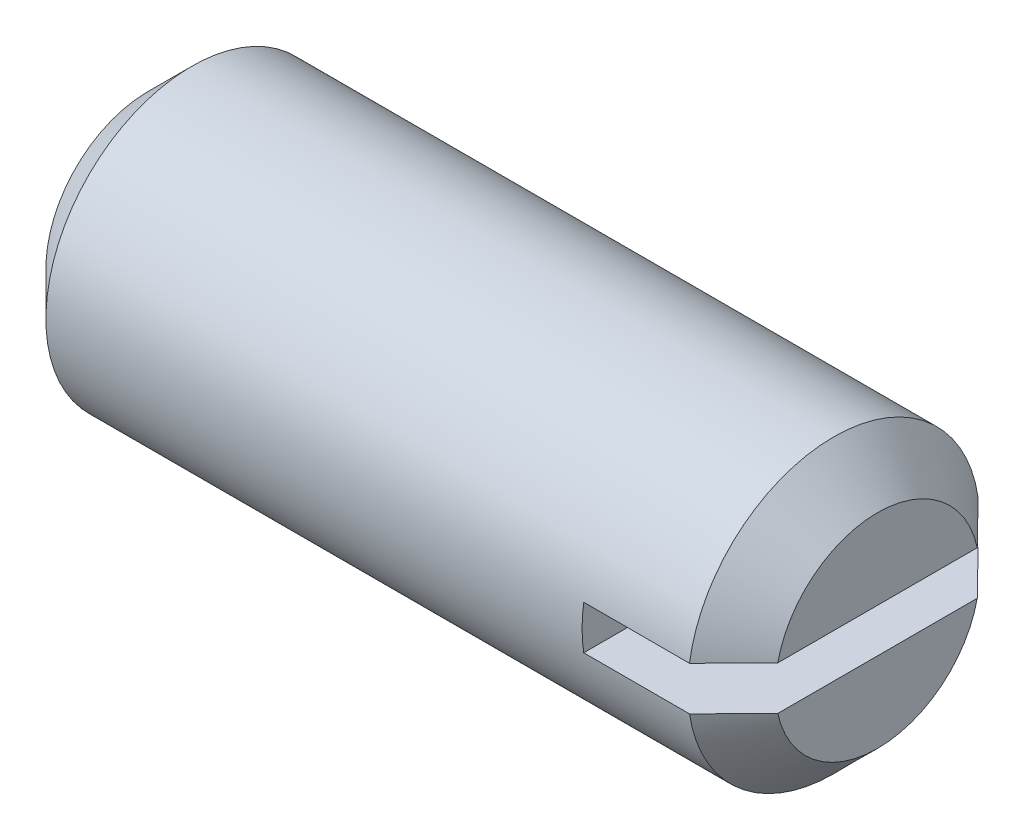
ISO-10303-21;
HEADER;
FILE_DESCRIPTION(('STEP AP214'),'2;1');
FILE_NAME('part.step','',(''),(''),'','','');
FILE_SCHEMA(('AUTOMOTIVE_DESIGN { 1 0 10303 214 1 1 1 1 }'));
ENDSEC;
DATA;
#1=APPLICATION_CONTEXT('core data for automotive mechanical design processes');
#2=APPLICATION_PROTOCOL_DEFINITION('international standard','automotive_design',2000,#1);
#3=PRODUCT_CONTEXT('',#1,'mechanical');
#4=PRODUCT('Part','Part','',(#3));
#5=PRODUCT_RELATED_PRODUCT_CATEGORY('part','',(#4));
#6=PRODUCT_DEFINITION_FORMATION('','',#4);
#7=PRODUCT_DEFINITION_CONTEXT('part definition',#1,'design');
#8=PRODUCT_DEFINITION('design','',#6,#7);
#9=PRODUCT_DEFINITION_SHAPE('','',#8);
#10=(LENGTH_UNIT() NAMED_UNIT(*) SI_UNIT(.MILLI.,.METRE.));
#11=(NAMED_UNIT(*) PLANE_ANGLE_UNIT() SI_UNIT($,.RADIAN.));
#12=(NAMED_UNIT(*) SI_UNIT($,.STERADIAN.) SOLID_ANGLE_UNIT());
#13=UNCERTAINTY_MEASURE_WITH_UNIT(LENGTH_MEASURE(1.E-05),#10,'distance_accuracy_value','');
#14=(GEOMETRIC_REPRESENTATION_CONTEXT(3) GLOBAL_UNCERTAINTY_ASSIGNED_CONTEXT((#13)) GLOBAL_UNIT_ASSIGNED_CONTEXT((#10,
#11,#12)) REPRESENTATION_CONTEXT('',''));
#15=CARTESIAN_POINT('',(0.,0.,0.));
#16=DIRECTION('',(0.,0.,1.));
#17=DIRECTION('',(1.,0.,0.));
#18=AXIS2_PLACEMENT_3D('',#15,#16,#17);
#19=CARTESIAN_POINT('',(10.,0.,0.));
#20=DIRECTION('',(1.,0.,0.));
#21=DIRECTION('',(0.,0.,-1.));
#22=AXIS2_PLACEMENT_3D('',#19,#20,#21);
#23=PLANE('',#22);
#24=DIRECTION('',(0.,0.,1.));
#25=VECTOR('',#24,1.);
#26=CARTESIAN_POINT('',(10.,-0.299999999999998,-2.));
#27=LINE('',#26,#25);
#28=CARTESIAN_POINT('',(10.,-0.299999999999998,-1.36747943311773));
#29=VERTEX_POINT('',#28);
#30=CARTESIAN_POINT('',(10.,-0.299999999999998,1.36747943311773));
#31=VERTEX_POINT('',#30);
#32=EDGE_CURVE('E106',#29,#31,#27,.T.);
#33=ORIENTED_EDGE('',*,*,#32,.T.);
#34=CARTESIAN_POINT('',(10.,0.,0.));
#35=DIRECTION('',(1.,0.,0.));
#36=DIRECTION('',(0.,0.,-1.));
#37=AXIS2_PLACEMENT_3D('',#34,#35,#36);
#38=CIRCLE('',#37,1.4);
#39=EDGE_CURVE('E110',#31,#29,#38,.T.);
#40=ORIENTED_EDGE('',*,*,#39,.T.);
#41=EDGE_LOOP('',(#33,#40));
#42=FACE_BOUND('',#41,.T.);
#43=ADVANCED_FACE('F37',(#42),#23,.T.);
#44=CARTESIAN_POINT('',(10.,0.,0.));
#45=DIRECTION('',(-1.,0.,0.));
#46=DIRECTION('',(0.,0.,1.));
#47=AXIS2_PLACEMENT_3D('',#44,#45,#46);
#48=CONICAL_SURFACE('',#47,1.4,0.785398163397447);
#49=CARTESIAN_POINT('',(6.9729501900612,-0.299999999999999,4.41687333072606));
#50=CARTESIAN_POINT('',(7.12518056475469,-0.299999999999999,4.26428929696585));
#51=CARTESIAN_POINT('',(7.2773955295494,-0.299999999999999,4.11168987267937));
#52=CARTESIAN_POINT('',(7.5817779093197,-0.299999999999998,3.80643657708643));
#53=CARTESIAN_POINT('',(7.73394532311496,-0.299999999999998,3.65378270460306));
#54=CARTESIAN_POINT('',(8.03828902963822,-0.299999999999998,3.34832340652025));
#55=CARTESIAN_POINT('',(8.19046528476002,-0.299999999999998,3.19551794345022));
#56=CARTESIAN_POINT('',(8.49470618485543,-0.299999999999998,2.88980275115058));
#57=CARTESIAN_POINT('',(8.64677083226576,-0.299999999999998,2.73689302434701));
#58=CARTESIAN_POINT('',(8.95144396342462,-0.299999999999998,2.4301728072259));
#59=CARTESIAN_POINT('',(9.10405160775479,-0.299999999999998,2.27636148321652));
#60=CARTESIAN_POINT('',(9.40896874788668,-0.299999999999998,1.96842290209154));
#61=CARTESIAN_POINT('',(9.56127822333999,-0.299999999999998,1.81429562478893));
#62=CARTESIAN_POINT('',(9.78922653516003,-0.299999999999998,1.58264732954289));
#63=CARTESIAN_POINT('',(9.86511078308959,-0.299999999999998,1.50536785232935));
#64=CARTESIAN_POINT('',(10.0166222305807,-0.299999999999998,1.35055270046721));
#65=CARTESIAN_POINT('',(10.0922494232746,-0.299999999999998,1.27301701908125));
#66=CARTESIAN_POINT('',(10.243056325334,-0.299999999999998,1.11753056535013));
#67=CARTESIAN_POINT('',(10.3182360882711,-0.299999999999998,1.0395798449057));
#68=CARTESIAN_POINT('',(10.4678059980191,-0.299999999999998,0.882925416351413));
#69=CARTESIAN_POINT('',(10.5421961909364,-0.299999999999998,0.804221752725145));
#70=CARTESIAN_POINT('',(10.6356658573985,-0.299999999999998,0.703043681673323));
#71=CARTESIAN_POINT('',(10.6555851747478,-0.299999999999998,0.681346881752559));
#72=CARTESIAN_POINT('',(10.6952398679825,-0.299999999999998,0.637784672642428));
#73=CARTESIAN_POINT('',(10.7149752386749,-0.299999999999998,0.615919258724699));
#74=CARTESIAN_POINT('',(10.7542172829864,-0.299999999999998,0.571956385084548));
#75=CARTESIAN_POINT('',(10.7737237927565,-0.299999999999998,0.549858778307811));
#76=CARTESIAN_POINT('',(10.8123947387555,-0.299999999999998,0.505370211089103));
#77=CARTESIAN_POINT('',(10.831559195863,-0.299999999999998,0.482979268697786));
#78=CARTESIAN_POINT('',(10.8806527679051,-0.299999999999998,0.424404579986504));
#79=CARTESIAN_POINT('',(10.9102267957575,-0.299999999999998,0.387914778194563));
#80=CARTESIAN_POINT('',(10.9528223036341,-0.299999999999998,0.331830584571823));
#81=CARTESIAN_POINT('',(10.9667265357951,-0.299999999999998,0.312910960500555));
#82=CARTESIAN_POINT('',(10.993636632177,-0.299999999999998,0.274447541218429));
#83=CARTESIAN_POINT('',(11.006642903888,-0.299999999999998,0.254904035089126));
#84=CARTESIAN_POINT('',(11.0315694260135,-0.299999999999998,0.214479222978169));
#85=CARTESIAN_POINT('',(11.0434566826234,-0.299999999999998,0.193577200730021));
#86=CARTESIAN_POINT('',(11.0648541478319,-0.299999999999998,0.150565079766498));
#87=CARTESIAN_POINT('',(11.0743676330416,-0.299999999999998,0.128456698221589));
#88=CARTESIAN_POINT('',(11.0877294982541,-0.299999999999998,0.0882149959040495));
#89=CARTESIAN_POINT('',(11.0923821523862,-0.299999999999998,0.0703597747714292));
#90=CARTESIAN_POINT('',(11.098585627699,-0.299999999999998,0.0341402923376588));
#91=CARTESIAN_POINT('',(11.1001458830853,-0.299999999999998,0.0157777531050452));
#92=CARTESIAN_POINT('',(11.0998316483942,-0.299999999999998,-0.020970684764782));
#93=CARTESIAN_POINT('',(11.0979468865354,-0.299999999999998,-0.0393564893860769));
#94=CARTESIAN_POINT('',(11.0911456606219,-0.299999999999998,-0.0755692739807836));
#95=CARTESIAN_POINT('',(11.0862216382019,-0.299999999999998,-0.0933947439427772));
#96=CARTESIAN_POINT('',(11.0734532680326,-0.299999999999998,-0.130257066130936));
#97=CARTESIAN_POINT('',(11.0653372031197,-0.299999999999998,-0.149195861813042));
#98=CARTESIAN_POINT('',(11.0472837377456,-0.299999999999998,-0.186199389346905));
#99=CARTESIAN_POINT('',(11.0373426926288,-0.299999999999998,-0.204262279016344));
#100=CARTESIAN_POINT('',(11.0161868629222,-0.299999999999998,-0.23983020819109));
#101=CARTESIAN_POINT('',(11.0049615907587,-0.299999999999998,-0.2573289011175));
#102=CARTESIAN_POINT('',(10.9817143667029,-0.299999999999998,-0.29175761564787));
#103=CARTESIAN_POINT('',(10.969693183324,-0.299999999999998,-0.308688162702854));
#104=CARTESIAN_POINT('',(10.9303995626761,-0.299999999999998,-0.362152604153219));
#105=CARTESIAN_POINT('',(10.9020827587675,-0.299999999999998,-0.397913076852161));
#106=CARTESIAN_POINT('',(10.8441431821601,-0.299999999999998,-0.468366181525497));
#107=CARTESIAN_POINT('',(10.8145196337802,-0.299999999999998,-0.503058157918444));
#108=CARTESIAN_POINT('',(10.7544631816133,-0.299999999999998,-0.571838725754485));
#109=CARTESIAN_POINT('',(10.724028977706,-0.299999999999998,-0.605926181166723));
#110=CARTESIAN_POINT('',(10.6626965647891,-0.299999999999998,-0.673661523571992));
#111=CARTESIAN_POINT('',(10.6317984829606,-0.299999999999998,-0.707309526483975));
#112=CARTESIAN_POINT('',(10.5389147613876,-0.299999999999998,-0.807530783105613));
#113=CARTESIAN_POINT('',(10.4764725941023,-0.299999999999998,-0.87368025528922));
#114=CARTESIAN_POINT('',(10.3510446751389,-0.299999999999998,-1.00533229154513));
#115=CARTESIAN_POINT('',(10.2880595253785,-0.299999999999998,-1.07083543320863));
#116=CARTESIAN_POINT('',(10.1580399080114,-0.299999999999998,-1.20531240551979));
#117=CARTESIAN_POINT('',(10.0909838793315,-0.299999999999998,-1.274265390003));
#118=CARTESIAN_POINT('',(9.95662574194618,-0.299999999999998,-1.41193132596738));
#119=CARTESIAN_POINT('',(9.8893236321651,-0.299999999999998,-1.48064427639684));
#120=CARTESIAN_POINT('',(9.68717692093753,-0.299999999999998,-1.68655187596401));
#121=CARTESIAN_POINT('',(9.55209434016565,-0.299999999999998,-1.82351280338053));
#122=CARTESIAN_POINT('',(9.28155242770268,-0.299999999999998,-2.0971960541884));
#123=CARTESIAN_POINT('',(9.14609294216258,-0.299999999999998,-2.23391822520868));
#124=CARTESIAN_POINT('',(8.87499302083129,-0.299999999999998,-2.50718073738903));
#125=CARTESIAN_POINT('',(8.73935258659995,-0.299999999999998,-2.64372108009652));
#126=CARTESIAN_POINT('',(8.46787274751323,-0.299999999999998,-2.91677606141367));
#127=CARTESIAN_POINT('',(8.33203327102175,-0.299999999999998,-3.0532906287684));
#128=CARTESIAN_POINT('',(8.0602782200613,-0.299999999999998,-3.32624477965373));
#129=CARTESIAN_POINT('',(7.92436264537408,-0.299999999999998,-3.46268436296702));
#130=CARTESIAN_POINT('',(7.65255240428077,-0.299999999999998,-3.73543735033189));
#131=CARTESIAN_POINT('',(7.51665776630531,-0.299999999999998,-3.87175078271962));
#132=CARTESIAN_POINT('',(7.24482977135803,-0.299999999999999,-4.14433820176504));
#133=CARTESIAN_POINT('',(7.10889641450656,-0.299999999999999,-4.28061218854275));
#134=CARTESIAN_POINT('',(6.9729501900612,-0.299999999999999,-4.41687333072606));
#135=B_SPLINE_CURVE_WITH_KNOTS('',3,(#49,#50,#51,#52,#53,#54,#55,#56,#57,#58,#59,#60,#61,#62,
#63,#64,#65,#66,#67,#68,#69,#70,#71,#72,#73,#74,#75,#76,#77,#78,#79,#80,#81,#82,#83,#84,#85,#86,
#87,#88,#89,#90,#91,#92,#93,#94,#95,#96,#97,#98,#99,#100,#101,#102,#103,#104,#105,#106,#107,
#108,#109,#110,#111,#112,#113,#114,#115,#116,#117,#118,#119,#120,#121,#122,#123,#124,#125,#126,
#127,#128,#129,#130,#131,#132,#133,#134),.UNSPECIFIED.,.F.,.F.,(4,2,2,2,2,2,2,2,2,2,2,2,2,2,2,2,
2,2,2,2,2,2,2,2,2,2,2,2,2,2,2,2,2,2,2,2,2,2,2,2,2,2,4),(0.,0.646609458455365,1.29323386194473,
1.94019913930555,2.58714984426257,3.2371675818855,3.88722823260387,4.21215082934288,
4.5370820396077,4.86197352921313,5.18684594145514,5.27520665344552,5.36356985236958,
5.45199286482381,5.54041046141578,5.68125501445,5.75167713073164,5.82206707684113,
5.89412318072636,5.9660792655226,6.02122366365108,6.07619956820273,6.13133965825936,
6.18661743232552,6.24828311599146,6.31007331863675,6.37241000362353,6.43468735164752,
6.57145228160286,6.70829951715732,6.84538129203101,6.98242614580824,7.25531345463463,
7.52792955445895,7.8164750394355,8.10502178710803,8.68212561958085,9.2595162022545,
9.83690183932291,10.4146537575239,10.9924073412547,11.5698485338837,12.1472879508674),.UNSPECIFIED.);
#136=CARTESIAN_POINT('',(9.4,-0.299999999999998,1.97737199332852));
#137=VERTEX_POINT('',#136);
#138=EDGE_CURVE('E164',#137,#31,#135,.T.);
#139=ORIENTED_EDGE('',*,*,#138,.F.);
#140=CARTESIAN_POINT('',(9.4,0.,0.));
#141=DIRECTION('',(1.,0.,0.));
#142=DIRECTION('',(0.,0.,-1.));
#143=AXIS2_PLACEMENT_3D('',#140,#141,#142);
#144=CIRCLE('',#143,2.);
#145=CARTESIAN_POINT('',(9.4,-0.299999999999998,-1.97737199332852));
#146=VERTEX_POINT('',#145);
#147=EDGE_CURVE('E120',#146,#137,#144,.F.);
#148=ORIENTED_EDGE('',*,*,#147,.F.);
#149=EDGE_CURVE('E98',#29,#146,#135,.T.);
#150=ORIENTED_EDGE('',*,*,#149,.F.);
#151=ORIENTED_EDGE('',*,*,#39,.F.);
#152=EDGE_LOOP('',(#139,#148,#150,#151));
#153=FACE_BOUND('',#152,.T.);
#154=ADVANCED_FACE('F148',(#153),#48,.T.);
#155=CARTESIAN_POINT('',(10.,0.,0.));
#156=DIRECTION('',(-1.,0.,0.));
#157=DIRECTION('',(0.,0.,1.));
#158=AXIS2_PLACEMENT_3D('',#155,#156,#157);
#159=CYLINDRICAL_SURFACE('',#158,2.);
#160=DIRECTION('',(-1.,0.,0.));
#161=VECTOR('',#160,1.);
#162=CARTESIAN_POINT('',(10.,0.300000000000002,-1.97737199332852));
#163=LINE('',#162,#161);
#164=CARTESIAN_POINT('',(9.4,0.300000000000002,-1.97737199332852));
#165=VERTEX_POINT('',#164);
#166=CARTESIAN_POINT('',(7.95,0.300000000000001,-1.97737199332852));
#167=VERTEX_POINT('',#166);
#168=EDGE_CURVE('E93',#165,#167,#163,.T.);
#169=ORIENTED_EDGE('',*,*,#168,.T.);
#170=CARTESIAN_POINT('',(7.95,0.,0.));
#171=DIRECTION('',(-1.,0.,0.));
#172=DIRECTION('',(0.,0.,1.));
#173=AXIS2_PLACEMENT_3D('',#170,#171,#172);
#174=CIRCLE('',#173,2.);
#175=CARTESIAN_POINT('',(7.95,-0.299999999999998,-1.97737199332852));
#176=VERTEX_POINT('',#175);
#177=EDGE_CURVE('E11',#167,#176,#174,.T.);
#178=ORIENTED_EDGE('',*,*,#177,.T.);
#179=DIRECTION('',(-1.,0.,0.));
#180=VECTOR('',#179,1.);
#181=CARTESIAN_POINT('',(10.,-0.299999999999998,-1.97737199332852));
#182=LINE('',#181,#180);
#183=EDGE_CURVE('E178',#176,#146,#182,.F.);
#184=ORIENTED_EDGE('',*,*,#183,.T.);
#185=ORIENTED_EDGE('',*,*,#147,.T.);
#186=DIRECTION('',(-1.,0.,0.));
#187=VECTOR('',#186,1.);
#188=CARTESIAN_POINT('',(10.,-0.299999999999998,1.97737199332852));
#189=LINE('',#188,#187);
#190=CARTESIAN_POINT('',(7.95,-0.299999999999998,1.97737199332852));
#191=VERTEX_POINT('',#190);
#192=EDGE_CURVE('E60',#137,#191,#189,.T.);
#193=ORIENTED_EDGE('',*,*,#192,.T.);
#194=CARTESIAN_POINT('',(7.95,0.300000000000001,1.97737199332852));
#195=VERTEX_POINT('',#194);
#196=EDGE_CURVE('E41',#191,#195,#174,.T.);
#197=ORIENTED_EDGE('',*,*,#196,.T.);
#198=DIRECTION('',(-1.,0.,0.));
#199=VECTOR('',#198,1.);
#200=CARTESIAN_POINT('',(10.,0.300000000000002,1.97737199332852));
#201=LINE('',#200,#199);
#202=CARTESIAN_POINT('',(9.4,0.300000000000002,1.97737199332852));
#203=VERTEX_POINT('',#202);
#204=EDGE_CURVE('E169',#195,#203,#201,.F.);
#205=ORIENTED_EDGE('',*,*,#204,.T.);
#206=EDGE_CURVE('E113',#203,#165,#144,.F.);
#207=ORIENTED_EDGE('',*,*,#206,.T.);
#208=EDGE_LOOP('',(#169,#178,#184,#185,#193,#197,#205,#207));
#209=FACE_BOUND('',#208,.T.);
#210=CARTESIAN_POINT('',(0.600000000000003,0.,0.));
#211=DIRECTION('',(1.,0.,0.));
#212=DIRECTION('',(0.,0.,-1.));
#213=AXIS2_PLACEMENT_3D('',#210,#211,#212);
#214=CIRCLE('',#213,2.);
#215=CARTESIAN_POINT('',(0.600000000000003,0.,-2.));
#216=VERTEX_POINT('',#215);
#217=EDGE_CURVE('E109',#216,#216,#214,.T.);
#218=ORIENTED_EDGE('',*,*,#217,.T.);
#219=EDGE_LOOP('',(#218));
#220=FACE_BOUND('',#219,.T.);
#221=ADVANCED_FACE('F144',(#209,#220),#159,.T.);
#222=DIRECTION('',(0.,0.,1.));
#223=VECTOR('',#222,1.);
#224=CARTESIAN_POINT('',(10.,0.300000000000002,-2.));
#225=LINE('',#224,#223);
#226=CARTESIAN_POINT('',(10.,0.300000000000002,-1.36747943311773));
#227=VERTEX_POINT('',#226);
#228=CARTESIAN_POINT('',(10.,0.300000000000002,1.36747943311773));
#229=VERTEX_POINT('',#228);
#230=EDGE_CURVE('E52',#227,#229,#225,.T.);
#231=ORIENTED_EDGE('',*,*,#230,.F.);
#232=EDGE_CURVE('E104',#227,#229,#38,.T.);
#233=ORIENTED_EDGE('',*,*,#232,.T.);
#234=EDGE_LOOP('',(#231,#233));
#235=FACE_BOUND('',#234,.T.);
#236=ADVANCED_FACE('F103',(#235),#23,.T.);
#237=CARTESIAN_POINT('',(0.,0.,0.));
#238=DIRECTION('',(1.,0.,0.));
#239=DIRECTION('',(0.,0.,-1.));
#240=AXIS2_PLACEMENT_3D('',#237,#238,#239);
#241=PLANE('',#240);
#242=CARTESIAN_POINT('',(0.,0.,0.));
#243=DIRECTION('',(1.,0.,0.));
#244=DIRECTION('',(0.,0.,-1.));
#245=AXIS2_PLACEMENT_3D('',#242,#243,#244);
#246=CIRCLE('',#245,1.4);
#247=CARTESIAN_POINT('',(0.,0.,-1.4));
#248=VERTEX_POINT('',#247);
#249=EDGE_CURVE('E121',#248,#248,#246,.F.);
#250=ORIENTED_EDGE('',*,*,#249,.T.);
#251=EDGE_LOOP('',(#250));
#252=FACE_BOUND('',#251,.T.);
#253=ADVANCED_FACE('F143',(#252),#241,.F.);
#254=CARTESIAN_POINT('',(6.9729501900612,0.300000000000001,-4.41687333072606));
#255=CARTESIAN_POINT('',(7.12518056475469,0.300000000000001,-4.26428929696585));
#256=CARTESIAN_POINT('',(7.2773955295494,0.300000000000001,-4.11168987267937));
#257=CARTESIAN_POINT('',(7.5817779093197,0.300000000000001,-3.80643657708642));
#258=CARTESIAN_POINT('',(7.73394532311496,0.300000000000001,-3.65378270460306));
#259=CARTESIAN_POINT('',(8.03828902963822,0.300000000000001,-3.34832340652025));
#260=CARTESIAN_POINT('',(8.19046528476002,0.300000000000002,-3.19551794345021));
#261=CARTESIAN_POINT('',(8.49470618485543,0.300000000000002,-2.88980275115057));
#262=CARTESIAN_POINT('',(8.64677083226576,0.300000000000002,-2.736893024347));
#263=CARTESIAN_POINT('',(8.95144396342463,0.300000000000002,-2.43017280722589));
#264=CARTESIAN_POINT('',(9.1040516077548,0.300000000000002,-2.27636148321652));
#265=CARTESIAN_POINT('',(9.40896874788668,0.300000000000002,-1.96842290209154));
#266=CARTESIAN_POINT('',(9.56127822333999,0.300000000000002,-1.81429562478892));
#267=CARTESIAN_POINT('',(9.78922653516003,0.300000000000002,-1.58264732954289));
#268=CARTESIAN_POINT('',(9.86511078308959,0.300000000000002,-1.50536785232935));
#269=CARTESIAN_POINT('',(10.0166222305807,0.300000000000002,-1.3505527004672));
#270=CARTESIAN_POINT('',(10.0922494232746,0.300000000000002,-1.27301701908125));
#271=CARTESIAN_POINT('',(10.243056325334,0.300000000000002,-1.11753056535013));
#272=CARTESIAN_POINT('',(10.3182360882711,0.300000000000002,-1.0395798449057));
#273=CARTESIAN_POINT('',(10.4678059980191,0.300000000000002,-0.882925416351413));
#274=CARTESIAN_POINT('',(10.5421961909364,0.300000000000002,-0.804221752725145));
#275=CARTESIAN_POINT('',(10.6356658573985,0.300000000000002,-0.703043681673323));
#276=CARTESIAN_POINT('',(10.6555851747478,0.300000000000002,-0.681346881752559));
#277=CARTESIAN_POINT('',(10.6952398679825,0.300000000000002,-0.637784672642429));
#278=CARTESIAN_POINT('',(10.7149752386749,0.300000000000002,-0.6159192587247));
#279=CARTESIAN_POINT('',(10.7542172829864,0.300000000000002,-0.571956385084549));
#280=CARTESIAN_POINT('',(10.7737237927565,0.300000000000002,-0.549858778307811));
#281=CARTESIAN_POINT('',(10.8123947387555,0.300000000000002,-0.505370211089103));
#282=CARTESIAN_POINT('',(10.831559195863,0.300000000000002,-0.482979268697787));
#283=CARTESIAN_POINT('',(10.8806527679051,0.300000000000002,-0.424404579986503));
#284=CARTESIAN_POINT('',(10.9102267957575,0.300000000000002,-0.387914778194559));
#285=CARTESIAN_POINT('',(10.9528223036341,0.300000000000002,-0.331830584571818));
#286=CARTESIAN_POINT('',(10.9667265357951,0.300000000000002,-0.31291096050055));
#287=CARTESIAN_POINT('',(10.993636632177,0.300000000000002,-0.274447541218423));
#288=CARTESIAN_POINT('',(11.006642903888,0.300000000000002,-0.254904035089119));
#289=CARTESIAN_POINT('',(11.0315694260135,0.300000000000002,-0.214479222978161));
#290=CARTESIAN_POINT('',(11.0434566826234,0.300000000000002,-0.193577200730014));
#291=CARTESIAN_POINT('',(11.0648541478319,0.300000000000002,-0.150565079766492));
#292=CARTESIAN_POINT('',(11.0743676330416,0.300000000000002,-0.128456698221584));
#293=CARTESIAN_POINT('',(11.0877294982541,0.300000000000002,-0.0882149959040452));
#294=CARTESIAN_POINT('',(11.0923821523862,0.300000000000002,-0.0703597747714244));
#295=CARTESIAN_POINT('',(11.098585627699,0.300000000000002,-0.0341402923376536));
#296=CARTESIAN_POINT('',(11.1001458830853,0.300000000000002,-0.0157777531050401));
#297=CARTESIAN_POINT('',(11.0998316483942,0.300000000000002,0.0209706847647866));
#298=CARTESIAN_POINT('',(11.0979468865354,0.300000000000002,0.0393564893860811));
#299=CARTESIAN_POINT('',(11.0911456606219,0.300000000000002,0.075569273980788));
#300=CARTESIAN_POINT('',(11.0862216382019,0.300000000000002,0.0933947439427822));
#301=CARTESIAN_POINT('',(11.0734532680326,0.300000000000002,0.130257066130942));
#302=CARTESIAN_POINT('',(11.0653372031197,0.300000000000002,0.149195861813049));
#303=CARTESIAN_POINT('',(11.0472837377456,0.300000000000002,0.186199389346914));
#304=CARTESIAN_POINT('',(11.0373426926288,0.300000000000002,0.204262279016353));
#305=CARTESIAN_POINT('',(11.0161868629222,0.300000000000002,0.2398302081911));
#306=CARTESIAN_POINT('',(11.0049615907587,0.300000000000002,0.257328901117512));
#307=CARTESIAN_POINT('',(10.9817143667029,0.300000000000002,0.291757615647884));
#308=CARTESIAN_POINT('',(10.9696931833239,0.300000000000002,0.308688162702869));
#309=CARTESIAN_POINT('',(10.9303995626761,0.300000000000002,0.362152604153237));
#310=CARTESIAN_POINT('',(10.9020827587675,0.300000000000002,0.39791307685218));
#311=CARTESIAN_POINT('',(10.84414318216,0.300000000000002,0.46836618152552));
#312=CARTESIAN_POINT('',(10.8145196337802,0.300000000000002,0.503058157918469));
#313=CARTESIAN_POINT('',(10.7544631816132,0.300000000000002,0.571838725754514));
#314=CARTESIAN_POINT('',(10.724028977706,0.300000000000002,0.605926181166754));
#315=CARTESIAN_POINT('',(10.6626965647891,0.300000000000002,0.673661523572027));
#316=CARTESIAN_POINT('',(10.6317984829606,0.300000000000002,0.707309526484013));
#317=CARTESIAN_POINT('',(10.5389147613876,0.300000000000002,0.807530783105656));
#318=CARTESIAN_POINT('',(10.4764725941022,0.300000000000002,0.873680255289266));
#319=CARTESIAN_POINT('',(10.3510446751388,0.300000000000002,1.00533229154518));
#320=CARTESIAN_POINT('',(10.2880595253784,0.300000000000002,1.07083543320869));
#321=CARTESIAN_POINT('',(10.1580399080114,0.300000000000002,1.20531240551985));
#322=CARTESIAN_POINT('',(10.0909838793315,0.300000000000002,1.27426539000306));
#323=CARTESIAN_POINT('',(9.95662574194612,0.300000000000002,1.41193132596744));
#324=CARTESIAN_POINT('',(9.88932363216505,0.300000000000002,1.48064427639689));
#325=CARTESIAN_POINT('',(9.68717692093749,0.300000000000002,1.68655187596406));
#326=CARTESIAN_POINT('',(9.55209434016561,0.300000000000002,1.82351280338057));
#327=CARTESIAN_POINT('',(9.28155242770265,0.300000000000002,2.09719605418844));
#328=CARTESIAN_POINT('',(9.14609294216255,0.300000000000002,2.23391822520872));
#329=CARTESIAN_POINT('',(8.87499302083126,0.300000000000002,2.50718073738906));
#330=CARTESIAN_POINT('',(8.73935258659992,0.300000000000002,2.64372108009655));
#331=CARTESIAN_POINT('',(8.4678727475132,0.300000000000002,2.91677606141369));
#332=CARTESIAN_POINT('',(8.33203327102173,0.300000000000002,3.05329062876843));
#333=CARTESIAN_POINT('',(8.06027822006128,0.300000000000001,3.32624477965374));
#334=CARTESIAN_POINT('',(7.92436264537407,0.300000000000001,3.46268436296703));
#335=CARTESIAN_POINT('',(7.65255240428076,0.300000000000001,3.7354373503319));
#336=CARTESIAN_POINT('',(7.5166577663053,0.300000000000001,3.87175078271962));
#337=CARTESIAN_POINT('',(7.24482977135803,0.300000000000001,4.14433820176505));
#338=CARTESIAN_POINT('',(7.10889641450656,0.300000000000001,4.28061218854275));
#339=CARTESIAN_POINT('',(6.9729501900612,0.300000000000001,4.41687333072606));
#340=B_SPLINE_CURVE_WITH_KNOTS('',3,(#254,#255,#256,#257,#258,#259,#260,#261,#262,#263,#264,
#265,#266,#267,#268,#269,#270,#271,#272,#273,#274,#275,#276,#277,#278,#279,#280,#281,#282,#283,
#284,#285,#286,#287,#288,#289,#290,#291,#292,#293,#294,#295,#296,#297,#298,#299,#300,#301,#302,
#303,#304,#305,#306,#307,#308,#309,#310,#311,#312,#313,#314,#315,#316,#317,#318,#319,#320,#321,
#322,#323,#324,#325,#326,#327,#328,#329,#330,#331,#332,#333,#334,#335,#336,#337,#338,#339),
.UNSPECIFIED.,.F.,.F.,(4,2,2,2,2,2,2,2,2,2,2,2,2,2,2,2,2,2,2,2,2,2,2,2,2,2,2,2,2,2,2,2,2,2,2,2,
2,2,2,2,2,2,4),(0.,0.646609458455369,1.29323386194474,1.94019913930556,2.58714984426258,
3.23716758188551,3.88722823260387,4.21215082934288,4.5370820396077,4.86197352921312,
5.18684594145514,5.27520665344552,5.36356985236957,5.45199286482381,5.54041046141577,
5.68125501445,5.75167713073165,5.82206707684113,5.89412318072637,5.9660792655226,
6.02122366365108,6.07619956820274,6.13133965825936,6.18661743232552,6.24828311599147,
6.31007331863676,6.37241000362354,6.43468735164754,6.57145228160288,6.70829951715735,
6.84538129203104,6.98242614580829,7.25531345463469,7.52792955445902,7.81647503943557,
8.1050217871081,8.6821256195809,9.25951620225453,9.83690183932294,10.4146537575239,
10.9924073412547,11.5698485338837,12.1472879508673),.UNSPECIFIED.);
#341=EDGE_CURVE('E89',#165,#227,#340,.T.);
#342=ORIENTED_EDGE('',*,*,#341,.F.);
#343=ORIENTED_EDGE('',*,*,#206,.F.);
#344=EDGE_CURVE('E99',#229,#203,#340,.T.);
#345=ORIENTED_EDGE('',*,*,#344,.F.);
#346=ORIENTED_EDGE('',*,*,#232,.F.);
#347=EDGE_LOOP('',(#342,#343,#345,#346));
#348=FACE_BOUND('',#347,.T.);
#349=ADVANCED_FACE('F108',(#348),#48,.T.);
#350=CARTESIAN_POINT('',(0.600000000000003,0.,0.));
#351=DIRECTION('',(1.,0.,0.));
#352=DIRECTION('',(0.,0.,-1.));
#353=AXIS2_PLACEMENT_3D('',#350,#351,#352);
#354=CONICAL_SURFACE('',#353,2.,0.78539816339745);
#355=ORIENTED_EDGE('',*,*,#249,.F.);
#356=EDGE_LOOP('',(#355));
#357=FACE_BOUND('',#356,.T.);
#358=ORIENTED_EDGE('',*,*,#217,.F.);
#359=EDGE_LOOP('',(#358));
#360=FACE_BOUND('',#359,.T.);
#361=ADVANCED_FACE('F39',(#357,#360),#354,.T.);
#362=CARTESIAN_POINT('',(7.95,-0.299999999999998,-2.));
#363=DIRECTION('',(-1.,0.,0.));
#364=DIRECTION('',(0.,0.,1.));
#365=AXIS2_PLACEMENT_3D('',#362,#363,#364);
#366=PLANE('',#365);
#367=DIRECTION('',(0.,0.,1.));
#368=VECTOR('',#367,1.);
#369=CARTESIAN_POINT('',(7.95,0.300000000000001,-2.));
#370=LINE('',#369,#368);
#371=EDGE_CURVE('E105',#167,#195,#370,.T.);
#372=ORIENTED_EDGE('',*,*,#371,.T.);
#373=ORIENTED_EDGE('',*,*,#196,.F.);
#374=DIRECTION('',(0.,0.,1.));
#375=VECTOR('',#374,1.);
#376=CARTESIAN_POINT('',(7.95,-0.299999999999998,-2.));
#377=LINE('',#376,#375);
#378=EDGE_CURVE('E173',#176,#191,#377,.T.);
#379=ORIENTED_EDGE('',*,*,#378,.F.);
#380=ORIENTED_EDGE('',*,*,#177,.F.);
#381=EDGE_LOOP('',(#372,#373,#379,#380));
#382=FACE_BOUND('',#381,.T.);
#383=ADVANCED_FACE('F137',(#382),#366,.F.);
#384=CARTESIAN_POINT('',(7.95,-0.299999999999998,-2.));
#385=DIRECTION('',(0.,-1.,0.));
#386=DIRECTION('',(1.,0.,0.));
#387=AXIS2_PLACEMENT_3D('',#384,#385,#386);
#388=PLANE('',#387);
#389=ORIENTED_EDGE('',*,*,#138,.T.);
#390=ORIENTED_EDGE('',*,*,#32,.F.);
#391=ORIENTED_EDGE('',*,*,#149,.T.);
#392=ORIENTED_EDGE('',*,*,#183,.F.);
#393=ORIENTED_EDGE('',*,*,#378,.T.);
#394=ORIENTED_EDGE('',*,*,#192,.F.);
#395=EDGE_LOOP('',(#389,#390,#391,#392,#393,#394));
#396=FACE_BOUND('',#395,.T.);
#397=ADVANCED_FACE('F136',(#396),#388,.F.);
#398=CARTESIAN_POINT('',(7.95,0.300000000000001,-2.));
#399=DIRECTION('',(0.,1.,0.));
#400=DIRECTION('',(-1.,0.,0.));
#401=AXIS2_PLACEMENT_3D('',#398,#399,#400);
#402=PLANE('',#401);
#403=ORIENTED_EDGE('',*,*,#341,.T.);
#404=ORIENTED_EDGE('',*,*,#230,.T.);
#405=ORIENTED_EDGE('',*,*,#344,.T.);
#406=ORIENTED_EDGE('',*,*,#204,.F.);
#407=ORIENTED_EDGE('',*,*,#371,.F.);
#408=ORIENTED_EDGE('',*,*,#168,.F.);
#409=EDGE_LOOP('',(#403,#404,#405,#406,#407,#408));
#410=FACE_BOUND('',#409,.T.);
#411=ADVANCED_FACE('F90',(#410),#402,.F.);
#412=CLOSED_SHELL('',(#43,#154,#221,#236,#253,#349,#361,#383,#397,#411));
#413=MANIFOLD_SOLID_BREP('B2',#412);
#414=ADVANCED_BREP_SHAPE_REPRESENTATION('',(#18,#413),#14);
#415=SHAPE_DEFINITION_REPRESENTATION(#9,#414);
ENDSEC;
END-ISO-10303-21;
